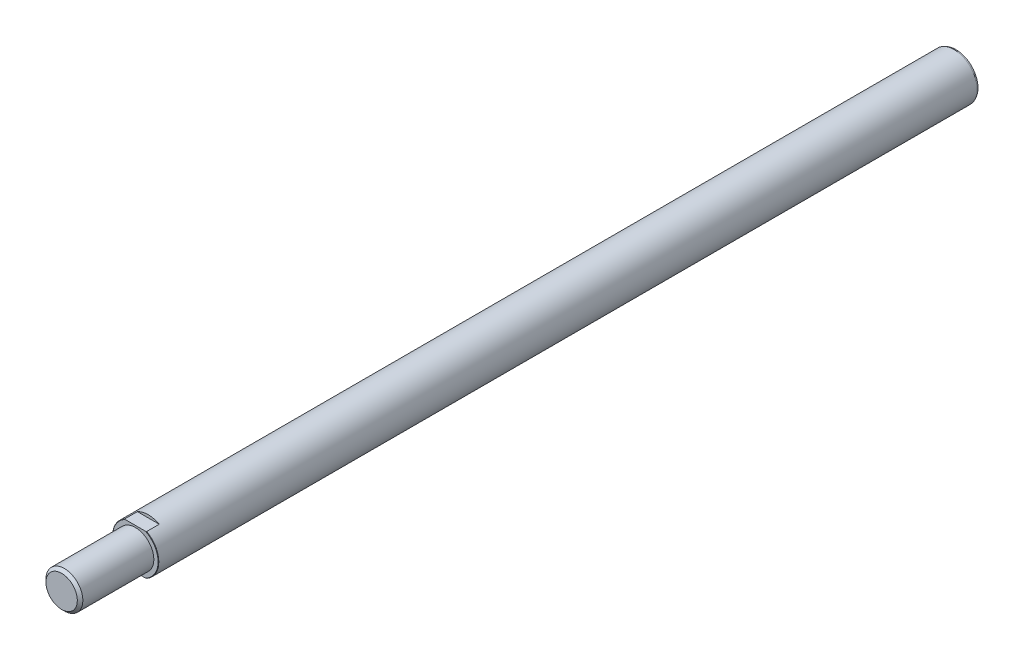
from build123d import *

# Parameters (mm, degrees)
ESBO_O1_R                       = 12.5
RESSALTO_EXTRUS_O1_DEPTH        = 485
ESBO_O2_OUTSIDE_W               = 124.258
ESBO_O2_OUTSIDE_H               = 124.258
ESBO_O2_OUTSIDE_R               = 10
CORTE_EXTRUS_O1_DEPTH           = 40
CHANFRO1_SIZE                   = 0.2
ESBO_O3_OUTSIDE_W               = 124.258
ESBO_O3_OUTSIDE_H               = 124.258
ESBO_O3_OUTSIDE_W_2             = 37.9352264
ESBO_O3_OUTSIDE_H_2             = 22
CORTE_EXTRUS_O2_DEPTH           = 7
CHANFRO2_SIZE                   = 1.5
ESBO_O4_OUTSIDE_W               = 124.258
ESBO_O4_OUTSIDE_H               = 124.258
ESBO_O4_OUTSIDE_R               = 12
CORTE_EXTRUS_O3_DEPTH           = 1
FURO_ROSCADO_DE_M12X1_751_D     = 10.2
FURO_ROSCADO_DE_M12X1_751_DEPTH = 32.75
FURO_ROSCADO_DE_M12X1_751_TIP   = 3.064389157


with BuildPart() as part:
    # Esbo_o1 → Ressalto-extrus_o1 (new body)
    with BuildSketch(Plane.XY):
        Circle(ESBO_O1_R)
    extrude(amount=RESSALTO_EXTRUS_O1_DEPTH)

    # Esbo_o2 outside → Corte-extrus_o1 (cut)
    with BuildSketch(Plane.XY.offset(485)):
        Rectangle(ESBO_O2_OUTSIDE_W, ESBO_O2_OUTSIDE_H)
        Circle(ESBO_O2_OUTSIDE_R, mode=Mode.SUBTRACT)
    extrude(amount=-CORTE_EXTRUS_O1_DEPTH, mode=Mode.SUBTRACT)

    # Chanfro1
    chanfro1_edges = [part.edges().sort_by_distance(p)[0] for p in [
        (-12.5, 0, 445),
    ]]
    chamfer(chanfro1_edges, length=CHANFRO1_SIZE)

    # Esbo_o3 outside → Corte-extrus_o2 (cut)
    with BuildSketch(Plane.XY.offset(445)):
        Rectangle(ESBO_O3_OUTSIDE_W, ESBO_O3_OUTSIDE_H)
        Rectangle(ESBO_O3_OUTSIDE_W_2, ESBO_O3_OUTSIDE_H_2, mode=Mode.SUBTRACT)
    extrude(amount=-CORTE_EXTRUS_O2_DEPTH, mode=Mode.SUBTRACT)

    # Chanfro2
    chanfro2_edges = [part.edges().sort_by_distance(p)[0] for p in [
        (-10, 0, 485),
    ]]
    chamfer(chanfro2_edges, length=CHANFRO2_SIZE)

    # Esbo_o4 outside → Corte-extrus_o3 (cut)
    with BuildSketch(Plane(origin=(0, 0, 0), x_dir=(-1, 0, 0), z_dir=(0, 0, -1))):
        Rectangle(ESBO_O4_OUTSIDE_W, ESBO_O4_OUTSIDE_H)
        Circle(ESBO_O4_OUTSIDE_R, mode=Mode.SUBTRACT)
    extrude(amount=-CORTE_EXTRUS_O3_DEPTH, mode=Mode.SUBTRACT)

    # Furo roscado de M12x1.751
    with Locations(Plane(origin=(0, 0, 0), x_dir=(-1, 0, 0), z_dir=(0, 0, -1))):
        with Locations((0, 0)):
            Hole(FURO_ROSCADO_DE_M12X1_751_D / 2, depth=FURO_ROSCADO_DE_M12X1_751_DEPTH)
            with Locations((0, 0, -(FURO_ROSCADO_DE_M12X1_751_DEPTH + FURO_ROSCADO_DE_M12X1_751_TIP / 2))):  # 118° drill point
                Cone(0, FURO_ROSCADO_DE_M12X1_751_D / 2, FURO_ROSCADO_DE_M12X1_751_TIP, mode=Mode.SUBTRACT)


solid = part.part
